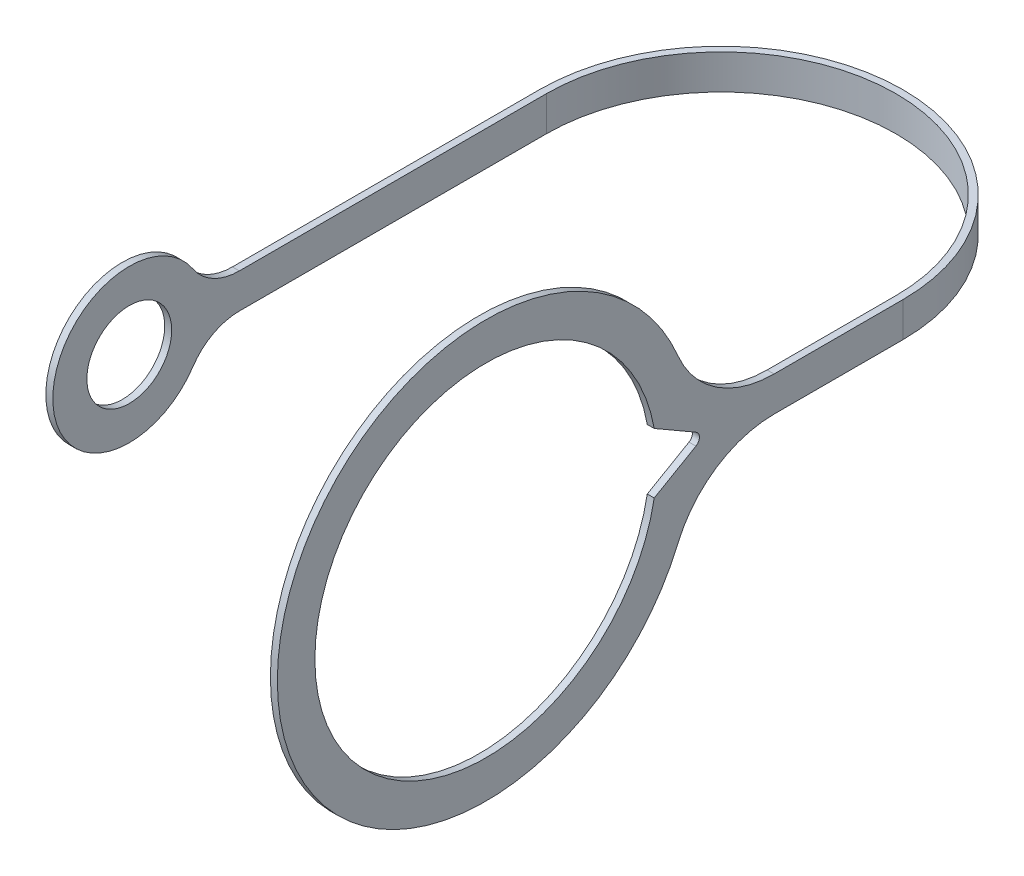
ISO-10303-21;
HEADER;
FILE_DESCRIPTION(('STEP AP214'),'2;1');
FILE_NAME('part.step','',(''),(''),'','','');
FILE_SCHEMA(('AUTOMOTIVE_DESIGN { 1 0 10303 214 1 1 1 1 }'));
ENDSEC;
DATA;
#1=APPLICATION_CONTEXT('core data for automotive mechanical design processes');
#2=APPLICATION_PROTOCOL_DEFINITION('international standard','automotive_design',2000,#1);
#3=PRODUCT_CONTEXT('',#1,'mechanical');
#4=PRODUCT('Part','Part','',(#3));
#5=PRODUCT_RELATED_PRODUCT_CATEGORY('part','',(#4));
#6=PRODUCT_DEFINITION_FORMATION('','',#4);
#7=PRODUCT_DEFINITION_CONTEXT('part definition',#1,'design');
#8=PRODUCT_DEFINITION('design','',#6,#7);
#9=PRODUCT_DEFINITION_SHAPE('','',#8);
#10=(LENGTH_UNIT() NAMED_UNIT(*) SI_UNIT(.MILLI.,.METRE.));
#11=(NAMED_UNIT(*) PLANE_ANGLE_UNIT() SI_UNIT($,.RADIAN.));
#12=(NAMED_UNIT(*) SI_UNIT($,.STERADIAN.) SOLID_ANGLE_UNIT());
#13=UNCERTAINTY_MEASURE_WITH_UNIT(LENGTH_MEASURE(1.E-05),#10,'distance_accuracy_value','');
#14=(GEOMETRIC_REPRESENTATION_CONTEXT(3) GLOBAL_UNCERTAINTY_ASSIGNED_CONTEXT((#13)) GLOBAL_UNIT_ASSIGNED_CONTEXT((#10,
#11,#12)) REPRESENTATION_CONTEXT('',''));
#15=CARTESIAN_POINT('',(0.,0.,0.));
#16=DIRECTION('',(0.,0.,1.));
#17=DIRECTION('',(1.,0.,0.));
#18=AXIS2_PLACEMENT_3D('',#15,#16,#17);
#19=CARTESIAN_POINT('',(-34.5848633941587,6.8347391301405,-7.91754381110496));
#20=DIRECTION('',(1.,0.,0.));
#21=DIRECTION('',(0.,0.,-1.));
#22=AXIS2_PLACEMENT_3D('',#19,#20,#21);
#23=CYLINDRICAL_SURFACE('',#22,4.);
#24=DIRECTION('',(1.,0.,0.));
#25=VECTOR('',#24,1.);
#26=CARTESIAN_POINT('',(-34.5848633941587,2.8347391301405,-7.91754381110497));
#27=LINE('',#26,#25);
#28=CARTESIAN_POINT('',(-34.8348633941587,2.8347391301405,-7.91754381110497));
#29=VERTEX_POINT('',#28);
#30=CARTESIAN_POINT('',(-34.3348633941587,2.8347391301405,-7.91754381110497));
#31=VERTEX_POINT('',#30);
#32=EDGE_CURVE('E131',#29,#31,#27,.T.);
#33=ORIENTED_EDGE('',*,*,#32,.F.);
#34=CARTESIAN_POINT('',(-34.8348633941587,6.8347391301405,-7.91754381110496));
#35=DIRECTION('',(1.,0.,0.));
#36=DIRECTION('',(0.,0.,-1.));
#37=AXIS2_PLACEMENT_3D('',#34,#35,#36);
#38=CIRCLE('',#37,4.);
#39=CARTESIAN_POINT('',(-34.8348633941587,4.62421281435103,-4.58384115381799));
#40=VERTEX_POINT('',#39);
#41=EDGE_CURVE('E20',#40,#29,#38,.T.);
#42=ORIENTED_EDGE('',*,*,#41,.F.);
#43=DIRECTION('',(1.,0.,0.));
#44=VECTOR('',#43,1.);
#45=CARTESIAN_POINT('',(-34.8348633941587,4.62421281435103,-4.58384115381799));
#46=LINE('',#45,#44);
#47=CARTESIAN_POINT('',(-34.3348633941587,4.62421281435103,-4.58384115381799));
#48=VERTEX_POINT('',#47);
#49=EDGE_CURVE('E129',#48,#40,#46,.F.);
#50=ORIENTED_EDGE('',*,*,#49,.F.);
#51=CARTESIAN_POINT('',(-34.3348633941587,6.8347391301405,-7.91754381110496));
#52=DIRECTION('',(1.,0.,0.));
#53=DIRECTION('',(0.,0.,-1.));
#54=AXIS2_PLACEMENT_3D('',#51,#52,#53);
#55=CIRCLE('',#54,4.);
#56=EDGE_CURVE('E154',#31,#48,#55,.F.);
#57=ORIENTED_EDGE('',*,*,#56,.F.);
#58=EDGE_LOOP('',(#33,#42,#50,#57));
#59=FACE_BOUND('',#58,.T.);
#60=ADVANCED_FACE('F17',(#59),#23,.F.);
#61=CARTESIAN_POINT('',(-34.8348633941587,1.5847391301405,-4.840794E-11));
#62=DIRECTION('',(1.,0.,0.));
#63=DIRECTION('',(0.,0.,-1.));
#64=AXIS2_PLACEMENT_3D('',#61,#62,#63);
#65=CYLINDRICAL_SURFACE('',#64,5.5);
#66=CARTESIAN_POINT('',(-34.3348633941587,1.5847391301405,-4.840794E-11));
#67=DIRECTION('',(1.,0.,0.));
#68=DIRECTION('',(0.,0.,-1.));
#69=AXIS2_PLACEMENT_3D('',#66,#67,#68);
#70=CIRCLE('',#69,5.5);
#71=CARTESIAN_POINT('',(-34.3348633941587,-1.45473455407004,-4.58384115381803));
#72=VERTEX_POINT('',#71);
#73=EDGE_CURVE('E144',#48,#72,#70,.T.);
#74=ORIENTED_EDGE('',*,*,#73,.F.);
#75=ORIENTED_EDGE('',*,*,#49,.T.);
#76=CARTESIAN_POINT('',(-34.8348633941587,1.5847391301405,-4.840794E-11));
#77=DIRECTION('',(1.,0.,0.));
#78=DIRECTION('',(0.,0.,-1.));
#79=AXIS2_PLACEMENT_3D('',#76,#77,#78);
#80=CIRCLE('',#79,5.5);
#81=CARTESIAN_POINT('',(-34.8348633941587,-1.45473455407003,-4.58384115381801));
#82=VERTEX_POINT('',#81);
#83=EDGE_CURVE('E141',#82,#40,#80,.F.);
#84=ORIENTED_EDGE('',*,*,#83,.F.);
#85=DIRECTION('',(1.,0.,0.));
#86=VECTOR('',#85,1.);
#87=CARTESIAN_POINT('',(-34.5848633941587,-1.45473455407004,-4.58384115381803));
#88=LINE('',#87,#86);
#89=EDGE_CURVE('E137',#82,#72,#88,.T.);
#90=ORIENTED_EDGE('',*,*,#89,.T.);
#91=EDGE_LOOP('',(#74,#75,#84,#90));
#92=FACE_BOUND('',#91,.T.);
#93=ADVANCED_FACE('F140',(#92),#65,.T.);
#94=CARTESIAN_POINT('',(-34.5848633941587,-3.66526086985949,-7.91754381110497));
#95=DIRECTION('',(1.,0.,0.));
#96=DIRECTION('',(0.,0.,-1.));
#97=AXIS2_PLACEMENT_3D('',#94,#95,#96);
#98=CYLINDRICAL_SURFACE('',#97,3.99999999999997);
#99=ORIENTED_EDGE('',*,*,#89,.F.);
#100=CARTESIAN_POINT('',(-34.8348633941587,-3.66526086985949,-7.91754381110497));
#101=DIRECTION('',(1.,0.,0.));
#102=DIRECTION('',(0.,0.,-1.));
#103=AXIS2_PLACEMENT_3D('',#100,#101,#102);
#104=CIRCLE('',#103,3.99999999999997);
#105=CARTESIAN_POINT('',(-34.8348633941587,0.334739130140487,-7.91754381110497));
#106=VERTEX_POINT('',#105);
#107=EDGE_CURVE('E136',#106,#82,#104,.T.);
#108=ORIENTED_EDGE('',*,*,#107,.F.);
#109=DIRECTION('',(1.,0.,0.));
#110=VECTOR('',#109,1.);
#111=CARTESIAN_POINT('',(-34.5848633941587,0.334739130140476,-7.91754381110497));
#112=LINE('',#111,#110);
#113=CARTESIAN_POINT('',(-34.3348633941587,0.334739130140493,-7.91754381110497));
#114=VERTEX_POINT('',#113);
#115=EDGE_CURVE('E146',#114,#106,#112,.F.);
#116=ORIENTED_EDGE('',*,*,#115,.F.);
#117=CARTESIAN_POINT('',(-34.3348633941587,-3.66526086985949,-7.91754381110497));
#118=DIRECTION('',(1.,0.,0.));
#119=DIRECTION('',(0.,0.,-1.));
#120=AXIS2_PLACEMENT_3D('',#117,#118,#119);
#121=CIRCLE('',#120,3.99999999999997);
#122=EDGE_CURVE('E159',#72,#114,#121,.F.);
#123=ORIENTED_EDGE('',*,*,#122,.F.);
#124=EDGE_LOOP('',(#99,#108,#116,#123));
#125=FACE_BOUND('',#124,.T.);
#126=ADVANCED_FACE('F424',(#125),#98,.F.);
#127=CARTESIAN_POINT('',(-34.5848633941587,1.5847391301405,-4.840794E-11));
#128=DIRECTION('',(1.,0.,0.));
#129=DIRECTION('',(0.,0.,-1.));
#130=AXIS2_PLACEMENT_3D('',#127,#128,#129);
#131=CYLINDRICAL_SURFACE('',#130,3.05);
#132=CARTESIAN_POINT('',(-34.3348633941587,1.5847391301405,-4.840794E-11));
#133=DIRECTION('',(1.,0.,0.));
#134=DIRECTION('',(0.,0.,-1.));
#135=AXIS2_PLACEMENT_3D('',#132,#133,#134);
#136=CIRCLE('',#135,3.05);
#137=CARTESIAN_POINT('',(-34.3348633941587,1.5847391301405,-3.05000000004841));
#138=VERTEX_POINT('',#137);
#139=EDGE_CURVE('E162',#138,#138,#136,.F.);
#140=ORIENTED_EDGE('',*,*,#139,.F.);
#141=EDGE_LOOP('',(#140));
#142=FACE_BOUND('',#141,.T.);
#143=CARTESIAN_POINT('',(-34.8348633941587,1.5847391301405,-4.840794E-11));
#144=DIRECTION('',(1.,0.,0.));
#145=DIRECTION('',(0.,0.,-1.));
#146=AXIS2_PLACEMENT_3D('',#143,#144,#145);
#147=CIRCLE('',#146,3.05);
#148=CARTESIAN_POINT('',(-34.8348633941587,1.5847391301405,-3.05000000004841));
#149=VERTEX_POINT('',#148);
#150=EDGE_CURVE('E151',#149,#149,#147,.T.);
#151=ORIENTED_EDGE('',*,*,#150,.F.);
#152=EDGE_LOOP('',(#151));
#153=FACE_BOUND('',#152,.T.);
#154=ADVANCED_FACE('F415',(#142,#153),#131,.F.);
#155=CARTESIAN_POINT('',(-34.8348633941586,1.58473913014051,-30.0000000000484));
#156=DIRECTION('',(-1.,0.,0.));
#157=DIRECTION('',(0.,0.,1.));
#158=AXIS2_PLACEMENT_3D('',#155,#156,#157);
#159=PLANE('',#158);
#160=ORIENTED_EDGE('',*,*,#150,.T.);
#161=EDGE_LOOP('',(#160));
#162=FACE_BOUND('',#161,.T.);
#163=ORIENTED_EDGE('',*,*,#107,.T.);
#164=ORIENTED_EDGE('',*,*,#83,.T.);
#165=ORIENTED_EDGE('',*,*,#41,.T.);
#166=DIRECTION('',(0.,0.,1.));
#167=VECTOR('',#166,1.);
#168=CARTESIAN_POINT('',(-34.8348633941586,2.8347391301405,-23.8655654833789));
#169=LINE('',#168,#167);
#170=CARTESIAN_POINT('',(-34.8348633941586,2.83473913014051,-30.0000000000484));
#171=VERTEX_POINT('',#170);
#172=EDGE_CURVE('E183',#171,#29,#169,.T.);
#173=ORIENTED_EDGE('',*,*,#172,.F.);
#174=DIRECTION('',(0.,-1.,0.));
#175=VECTOR('',#174,1.);
#176=CARTESIAN_POINT('',(-34.8348633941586,1.5847391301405,-30.0000000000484));
#177=LINE('',#176,#175);
#178=CARTESIAN_POINT('',(-34.8348633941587,0.334739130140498,-30.0000000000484));
#179=VERTEX_POINT('',#178);
#180=EDGE_CURVE('E178',#179,#171,#177,.F.);
#181=ORIENTED_EDGE('',*,*,#180,.F.);
#182=DIRECTION('',(0.,0.,-1.));
#183=VECTOR('',#182,1.);
#184=CARTESIAN_POINT('',(-34.8348633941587,0.334739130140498,-23.8655654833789));
#185=LINE('',#184,#183);
#186=EDGE_CURVE('E179',#106,#179,#185,.T.);
#187=ORIENTED_EDGE('',*,*,#186,.F.);
#188=EDGE_LOOP('',(#163,#164,#165,#173,#181,#187));
#189=FACE_BOUND('',#188,.T.);
#190=ADVANCED_FACE('F148',(#162,#189),#159,.T.);
#191=CARTESIAN_POINT('',(-34.3348633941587,1.5847391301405,-4.840794E-11));
#192=DIRECTION('',(1.,0.,0.));
#193=DIRECTION('',(0.,0.,-1.));
#194=AXIS2_PLACEMENT_3D('',#191,#192,#193);
#195=PLANE('',#194);
#196=ORIENTED_EDGE('',*,*,#139,.T.);
#197=EDGE_LOOP('',(#196));
#198=FACE_BOUND('',#197,.T.);
#199=ORIENTED_EDGE('',*,*,#73,.T.);
#200=ORIENTED_EDGE('',*,*,#122,.T.);
#201=DIRECTION('',(0.,0.,-1.));
#202=VECTOR('',#201,1.);
#203=CARTESIAN_POINT('',(-34.3348633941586,0.334739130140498,-23.8655654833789));
#204=LINE('',#203,#202);
#205=CARTESIAN_POINT('',(-34.3348633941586,0.334739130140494,-30.0000000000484));
#206=VERTEX_POINT('',#205);
#207=EDGE_CURVE('E173',#206,#114,#204,.F.);
#208=ORIENTED_EDGE('',*,*,#207,.F.);
#209=DIRECTION('',(0.,-1.,0.));
#210=VECTOR('',#209,1.);
#211=CARTESIAN_POINT('',(-34.3348633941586,1.5847391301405,-30.0000000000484));
#212=LINE('',#211,#210);
#213=CARTESIAN_POINT('',(-34.3348633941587,2.83473913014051,-30.0000000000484));
#214=VERTEX_POINT('',#213);
#215=EDGE_CURVE('E165',#206,#214,#212,.F.);
#216=ORIENTED_EDGE('',*,*,#215,.T.);
#217=DIRECTION('',(0.,0.,1.));
#218=VECTOR('',#217,1.);
#219=CARTESIAN_POINT('',(-34.3348633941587,2.8347391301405,-23.8655654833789));
#220=LINE('',#219,#218);
#221=EDGE_CURVE('E188',#31,#214,#220,.F.);
#222=ORIENTED_EDGE('',*,*,#221,.F.);
#223=ORIENTED_EDGE('',*,*,#56,.T.);
#224=EDGE_LOOP('',(#199,#200,#208,#216,#222,#223));
#225=FACE_BOUND('',#224,.T.);
#226=ADVANCED_FACE('F398',(#198,#225),#195,.T.);
#227=CARTESIAN_POINT('',(-21.7598633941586,1.5847391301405,-30.0000000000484));
#228=DIRECTION('',(0.,-1.,0.));
#229=DIRECTION('',(0.,0.,-1.));
#230=AXIS2_PLACEMENT_3D('',#227,#228,#229);
#231=CYLINDRICAL_SURFACE('',#230,12.575);
#232=DIRECTION('',(0.,1.,0.));
#233=VECTOR('',#232,1.);
#234=CARTESIAN_POINT('',(-9.18486339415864,1.58473913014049,-30.0000000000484));
#235=LINE('',#234,#233);
#236=CARTESIAN_POINT('',(-9.18486339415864,2.83473913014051,-30.0000000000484));
#237=VERTEX_POINT('',#236);
#238=CARTESIAN_POINT('',(-9.18486229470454,0.33473913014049,-30.0000000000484));
#239=VERTEX_POINT('',#238);
#240=EDGE_CURVE('E169',#237,#239,#235,.F.);
#241=ORIENTED_EDGE('',*,*,#240,.F.);
#242=CARTESIAN_POINT('',(-21.7598633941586,2.83473913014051,-30.0000000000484));
#243=DIRECTION('',(0.,-1.,0.));
#244=DIRECTION('',(0.,0.,-1.));
#245=AXIS2_PLACEMENT_3D('',#242,#243,#244);
#246=CIRCLE('',#245,12.575);
#247=EDGE_CURVE('E184',#214,#237,#246,.T.);
#248=ORIENTED_EDGE('',*,*,#247,.F.);
#249=ORIENTED_EDGE('',*,*,#215,.F.);
#250=CARTESIAN_POINT('',(-21.7598633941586,0.33473913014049,-30.0000000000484));
#251=DIRECTION('',(0.,-1.,0.));
#252=DIRECTION('',(0.,0.,-1.));
#253=AXIS2_PLACEMENT_3D('',#250,#251,#252);
#254=CIRCLE('',#253,12.575);
#255=EDGE_CURVE('E170',#239,#206,#254,.F.);
#256=ORIENTED_EDGE('',*,*,#255,.F.);
#257=EDGE_LOOP('',(#241,#248,#249,#256));
#258=FACE_BOUND('',#257,.T.);
#259=ADVANCED_FACE('F390',(#258),#231,.F.);
#260=CARTESIAN_POINT('',(-9.18486339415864,1.58473913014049,-30.0000000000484));
#261=DIRECTION('',(-1.,0.,0.));
#262=DIRECTION('',(0.,0.,1.));
#263=AXIS2_PLACEMENT_3D('',#260,#261,#262);
#264=PLANE('',#263);
#265=DIRECTION('',(0.,-0.500000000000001,0.866025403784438));
#266=VECTOR('',#265,1.);
#267=CARTESIAN_POINT('',(-9.18486229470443,-0.58032437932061,-12.1079519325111));
#268=LINE('',#267,#266);
#269=CARTESIAN_POINT('',(-9.18486284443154,1.15172642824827,-15.1079519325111));
#270=VERTEX_POINT('',#269);
#271=CARTESIAN_POINT('',(-9.18486284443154,-0.580324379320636,-12.107951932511));
#272=VERTEX_POINT('',#271);
#273=EDGE_CURVE('E201',#270,#272,#268,.T.);
#274=ORIENTED_EDGE('',*,*,#273,.F.);
#275=CARTESIAN_POINT('',(-9.18486339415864,1.58473913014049,-14.8579519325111));
#276=DIRECTION('',(-1.,0.,0.));
#277=DIRECTION('',(0.,0.,1.));
#278=AXIS2_PLACEMENT_3D('',#275,#276,#277);
#279=CIRCLE('',#278,0.500000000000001);
#280=CARTESIAN_POINT('',(-9.18486284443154,2.01775183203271,-15.1079519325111));
#281=VERTEX_POINT('',#280);
#282=EDGE_CURVE('E198',#270,#281,#279,.F.);
#283=ORIENTED_EDGE('',*,*,#282,.T.);
#284=DIRECTION('',(0.,-0.5,-0.866025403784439));
#285=VECTOR('',#284,1.);
#286=CARTESIAN_POINT('',(-9.18486229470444,2.01775183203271,-15.1079519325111));
#287=LINE('',#286,#285);
#288=CARTESIAN_POINT('',(-9.18486284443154,3.74980263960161,-12.107951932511));
#289=VERTEX_POINT('',#288);
#290=EDGE_CURVE('E230',#289,#281,#287,.T.);
#291=ORIENTED_EDGE('',*,*,#290,.F.);
#292=CARTESIAN_POINT('',(-9.18486339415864,1.58473913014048,0.));
#293=DIRECTION('',(-1.,0.,0.));
#294=DIRECTION('',(0.,0.,1.));
#295=AXIS2_PLACEMENT_3D('',#292,#293,#294);
#296=CIRCLE('',#295,12.3);
#297=EDGE_CURVE('E203',#289,#272,#296,.F.);
#298=ORIENTED_EDGE('',*,*,#297,.T.);
#299=EDGE_LOOP('',(#274,#283,#291,#298));
#300=FACE_BOUND('',#299,.T.);
#301=CARTESIAN_POINT('',(-9.18486339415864,1.58473913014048,0.));
#302=DIRECTION('',(-1.,0.,0.));
#303=DIRECTION('',(0.,0.,1.));
#304=AXIS2_PLACEMENT_3D('',#301,#302,#303);
#305=CIRCLE('',#304,15.);
#306=CARTESIAN_POINT('',(-9.18486339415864,7.41807246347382,-13.8192699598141));
#307=VERTEX_POINT('',#306);
#308=CARTESIAN_POINT('',(-9.18486339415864,-4.24859420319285,-13.8192699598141));
#309=VERTEX_POINT('',#308);
#310=EDGE_CURVE('E194',#307,#309,#305,.F.);
#311=ORIENTED_EDGE('',*,*,#310,.F.);
#312=CARTESIAN_POINT('',(-9.18486339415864,10.3347391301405,-20.7289049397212));
#313=DIRECTION('',(-1.,0.,0.));
#314=DIRECTION('',(0.,0.,1.));
#315=AXIS2_PLACEMENT_3D('',#312,#313,#314);
#316=CIRCLE('',#315,7.50000000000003);
#317=CARTESIAN_POINT('',(-9.18486339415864,2.83473913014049,-20.7289049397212));
#318=VERTEX_POINT('',#317);
#319=EDGE_CURVE('E189',#307,#318,#316,.F.);
#320=ORIENTED_EDGE('',*,*,#319,.T.);
#321=DIRECTION('',(0.,0.,1.));
#322=VECTOR('',#321,1.);
#323=CARTESIAN_POINT('',(-9.18486339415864,2.8347391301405,-23.8655654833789));
#324=LINE('',#323,#322);
#325=EDGE_CURVE('E187',#237,#318,#324,.T.);
#326=ORIENTED_EDGE('',*,*,#325,.F.);
#327=ORIENTED_EDGE('',*,*,#240,.T.);
#328=DIRECTION('',(0.,0.,-1.));
#329=VECTOR('',#328,1.);
#330=CARTESIAN_POINT('',(-9.18486119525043,0.334739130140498,-23.8655654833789));
#331=LINE('',#330,#329);
#332=CARTESIAN_POINT('',(-9.18486229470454,0.334739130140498,-20.7289049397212));
#333=VERTEX_POINT('',#332);
#334=EDGE_CURVE('E174',#333,#239,#331,.T.);
#335=ORIENTED_EDGE('',*,*,#334,.F.);
#336=CARTESIAN_POINT('',(-9.18486339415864,-7.16526086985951,-20.7289049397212));
#337=DIRECTION('',(-1.,0.,0.));
#338=DIRECTION('',(0.,0.,1.));
#339=AXIS2_PLACEMENT_3D('',#336,#337,#338);
#340=CIRCLE('',#339,7.49999999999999);
#341=EDGE_CURVE('E166',#333,#309,#340,.F.);
#342=ORIENTED_EDGE('',*,*,#341,.T.);
#343=EDGE_LOOP('',(#311,#320,#326,#327,#335,#342));
#344=FACE_BOUND('',#343,.T.);
#345=ADVANCED_FACE('F274',(#300,#344),#264,.T.);
#346=CARTESIAN_POINT('',(-8.93486119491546,-7.16526086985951,-20.7289049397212));
#347=DIRECTION('',(-1.,0.,0.));
#348=DIRECTION('',(0.,0.,1.));
#349=AXIS2_PLACEMENT_3D('',#346,#347,#348);
#350=CYLINDRICAL_SURFACE('',#349,7.49999999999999);
#351=DIRECTION('',(1.,0.,0.));
#352=VECTOR('',#351,1.);
#353=CARTESIAN_POINT('',(-21.7598629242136,0.334739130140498,-20.7289049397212));
#354=LINE('',#353,#352);
#355=CARTESIAN_POINT('',(-8.68486119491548,0.334739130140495,-20.7289049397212));
#356=VERTEX_POINT('',#355);
#357=EDGE_CURVE('E168',#356,#333,#354,.F.);
#358=ORIENTED_EDGE('',*,*,#357,.F.);
#359=CARTESIAN_POINT('',(-8.68486119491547,-7.16526086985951,-20.7289049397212));
#360=DIRECTION('',(-1.,0.,0.));
#361=DIRECTION('',(0.,0.,1.));
#362=AXIS2_PLACEMENT_3D('',#359,#360,#361);
#363=CIRCLE('',#362,7.49999999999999);
#364=CARTESIAN_POINT('',(-8.68486119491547,-4.24859420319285,-13.8192699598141));
#365=VERTEX_POINT('',#364);
#366=EDGE_CURVE('E206',#365,#356,#363,.T.);
#367=ORIENTED_EDGE('',*,*,#366,.F.);
#368=DIRECTION('',(-1.,0.,0.));
#369=VECTOR('',#368,1.);
#370=CARTESIAN_POINT('',(-8.68486119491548,-4.24859420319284,-13.8192699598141));
#371=LINE('',#370,#369);
#372=EDGE_CURVE('E197',#309,#365,#371,.F.);
#373=ORIENTED_EDGE('',*,*,#372,.F.);
#374=ORIENTED_EDGE('',*,*,#341,.F.);
#375=EDGE_LOOP('',(#358,#367,#373,#374));
#376=FACE_BOUND('',#375,.T.);
#377=ADVANCED_FACE('F373',(#376),#350,.F.);
#378=CARTESIAN_POINT('',(-21.7598629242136,0.334739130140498,-23.8655654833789));
#379=DIRECTION('',(0.,-1.,0.));
#380=DIRECTION('',(0.,0.,-1.));
#381=AXIS2_PLACEMENT_3D('',#378,#379,#380);
#382=PLANE('',#381);
#383=CARTESIAN_POINT('',(-21.7598633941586,0.334739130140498,-30.0000000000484));
#384=DIRECTION('',(0.,-1.,0.));
#385=DIRECTION('',(0.,0.,-1.));
#386=AXIS2_PLACEMENT_3D('',#383,#384,#385);
#387=CIRCLE('',#386,13.075);
#388=CARTESIAN_POINT('',(-8.68486229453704,0.334739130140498,-30.0000000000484));
#389=VERTEX_POINT('',#388);
#390=EDGE_CURVE('E175',#389,#179,#387,.F.);
#391=ORIENTED_EDGE('',*,*,#390,.F.);
#392=DIRECTION('',(0.,0.,-1.));
#393=VECTOR('',#392,1.);
#394=CARTESIAN_POINT('',(-8.68486119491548,0.334739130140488,-4.837908E-11));
#395=LINE('',#394,#393);
#396=EDGE_CURVE('E210',#356,#389,#395,.T.);
#397=ORIENTED_EDGE('',*,*,#396,.F.);
#398=ORIENTED_EDGE('',*,*,#357,.T.);
#399=ORIENTED_EDGE('',*,*,#334,.T.);
#400=ORIENTED_EDGE('',*,*,#255,.T.);
#401=ORIENTED_EDGE('',*,*,#207,.T.);
#402=ORIENTED_EDGE('',*,*,#115,.T.);
#403=ORIENTED_EDGE('',*,*,#186,.T.);
#404=EDGE_LOOP('',(#391,#397,#398,#399,#400,#401,#402,#403));
#405=FACE_BOUND('',#404,.T.);
#406=ADVANCED_FACE('F364',(#405),#382,.T.);
#407=CARTESIAN_POINT('',(-21.7598633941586,1.5847391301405,-30.0000000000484));
#408=DIRECTION('',(0.,-1.,0.));
#409=DIRECTION('',(0.,0.,-1.));
#410=AXIS2_PLACEMENT_3D('',#407,#408,#409);
#411=CYLINDRICAL_SURFACE('',#410,13.075);
#412=CARTESIAN_POINT('',(-21.7598633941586,2.83473913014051,-30.0000000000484));
#413=DIRECTION('',(0.,-1.,0.));
#414=DIRECTION('',(0.,0.,-1.));
#415=AXIS2_PLACEMENT_3D('',#412,#413,#414);
#416=CIRCLE('',#415,13.075);
#417=CARTESIAN_POINT('',(-8.68486229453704,2.83473913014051,-30.0000000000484));
#418=VERTEX_POINT('',#417);
#419=EDGE_CURVE('E180',#418,#171,#416,.F.);
#420=ORIENTED_EDGE('',*,*,#419,.F.);
#421=DIRECTION('',(0.,1.,0.));
#422=VECTOR('',#421,1.);
#423=CARTESIAN_POINT('',(-8.68486119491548,1.58473913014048,-30.0000000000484));
#424=LINE('',#423,#422);
#425=EDGE_CURVE('E239',#389,#418,#424,.T.);
#426=ORIENTED_EDGE('',*,*,#425,.F.);
#427=ORIENTED_EDGE('',*,*,#390,.T.);
#428=ORIENTED_EDGE('',*,*,#180,.T.);
#429=EDGE_LOOP('',(#420,#426,#427,#428));
#430=FACE_BOUND('',#429,.T.);
#431=ADVANCED_FACE('F355',(#430),#411,.T.);
#432=CARTESIAN_POINT('',(-21.7598629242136,2.8347391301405,-23.8655654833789));
#433=DIRECTION('',(0.,1.,0.));
#434=DIRECTION('',(0.,0.,1.));
#435=AXIS2_PLACEMENT_3D('',#432,#433,#434);
#436=PLANE('',#435);
#437=ORIENTED_EDGE('',*,*,#247,.T.);
#438=ORIENTED_EDGE('',*,*,#325,.T.);
#439=DIRECTION('',(-1.,0.,0.));
#440=VECTOR('',#439,1.);
#441=CARTESIAN_POINT('',(-8.93486119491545,2.83473913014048,-20.7289049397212));
#442=LINE('',#441,#440);
#443=CARTESIAN_POINT('',(-8.68486119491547,2.83473913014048,-20.7289049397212));
#444=VERTEX_POINT('',#443);
#445=EDGE_CURVE('E193',#318,#444,#442,.F.);
#446=ORIENTED_EDGE('',*,*,#445,.T.);
#447=DIRECTION('',(0.,0.,-1.));
#448=VECTOR('',#447,1.);
#449=CARTESIAN_POINT('',(-8.68486119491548,2.8347391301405,-4.837908E-11));
#450=LINE('',#449,#448);
#451=EDGE_CURVE('E215',#418,#444,#450,.F.);
#452=ORIENTED_EDGE('',*,*,#451,.F.);
#453=ORIENTED_EDGE('',*,*,#419,.T.);
#454=ORIENTED_EDGE('',*,*,#172,.T.);
#455=ORIENTED_EDGE('',*,*,#32,.T.);
#456=ORIENTED_EDGE('',*,*,#221,.T.);
#457=EDGE_LOOP('',(#437,#438,#446,#452,#453,#454,#455,#456));
#458=FACE_BOUND('',#457,.T.);
#459=ADVANCED_FACE('F346',(#458),#436,.T.);
#460=CARTESIAN_POINT('',(-8.93486119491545,10.3347391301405,-20.7289049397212));
#461=DIRECTION('',(-1.,0.,0.));
#462=DIRECTION('',(0.,0.,1.));
#463=AXIS2_PLACEMENT_3D('',#460,#461,#462);
#464=CYLINDRICAL_SURFACE('',#463,7.50000000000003);
#465=DIRECTION('',(-1.,0.,0.));
#466=VECTOR('',#465,1.);
#467=CARTESIAN_POINT('',(-8.68486119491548,7.41807246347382,-13.8192699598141));
#468=LINE('',#467,#466);
#469=CARTESIAN_POINT('',(-8.68486119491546,7.41807246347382,-13.8192699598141));
#470=VERTEX_POINT('',#469);
#471=EDGE_CURVE('E192',#470,#307,#468,.T.);
#472=ORIENTED_EDGE('',*,*,#471,.F.);
#473=CARTESIAN_POINT('',(-8.68486119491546,10.3347391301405,-20.7289049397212));
#474=DIRECTION('',(-1.,0.,0.));
#475=DIRECTION('',(0.,0.,1.));
#476=AXIS2_PLACEMENT_3D('',#473,#474,#475);
#477=CIRCLE('',#476,7.50000000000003);
#478=EDGE_CURVE('E211',#444,#470,#477,.T.);
#479=ORIENTED_EDGE('',*,*,#478,.F.);
#480=ORIENTED_EDGE('',*,*,#445,.F.);
#481=ORIENTED_EDGE('',*,*,#319,.F.);
#482=EDGE_LOOP('',(#472,#479,#480,#481));
#483=FACE_BOUND('',#482,.T.);
#484=ADVANCED_FACE('F291',(#483),#464,.F.);
#485=CARTESIAN_POINT('',(-8.68486119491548,1.58473913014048,0.));
#486=DIRECTION('',(-1.,0.,0.));
#487=DIRECTION('',(0.,0.,1.));
#488=AXIS2_PLACEMENT_3D('',#485,#486,#487);
#489=CYLINDRICAL_SURFACE('',#488,15.);
#490=ORIENTED_EDGE('',*,*,#310,.T.);
#491=ORIENTED_EDGE('',*,*,#372,.T.);
#492=CARTESIAN_POINT('',(-8.68486119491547,1.58473913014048,0.));
#493=DIRECTION('',(-1.,0.,0.));
#494=DIRECTION('',(0.,0.,1.));
#495=AXIS2_PLACEMENT_3D('',#492,#493,#494);
#496=CIRCLE('',#495,15.);
#497=EDGE_CURVE('E214',#470,#365,#496,.F.);
#498=ORIENTED_EDGE('',*,*,#497,.F.);
#499=ORIENTED_EDGE('',*,*,#471,.T.);
#500=EDGE_LOOP('',(#490,#491,#498,#499));
#501=FACE_BOUND('',#500,.T.);
#502=ADVANCED_FACE('F283',(#501),#489,.T.);
#503=CARTESIAN_POINT('',(-8.68486119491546,2.01775183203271,-15.1079519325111));
#504=DIRECTION('',(0.,-0.866025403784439,0.5));
#505=DIRECTION('',(0.,-0.5,-0.866025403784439));
#506=AXIS2_PLACEMENT_3D('',#503,#504,#505);
#507=PLANE('',#506);
#508=DIRECTION('',(0.,-0.500000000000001,-0.866025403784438));
#509=VECTOR('',#508,1.);
#510=CARTESIAN_POINT('',(-8.68486119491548,3.74980263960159,-12.1079519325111));
#511=LINE('',#510,#509);
#512=CARTESIAN_POINT('',(-8.68486119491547,3.74980263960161,-12.107951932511));
#513=VERTEX_POINT('',#512);
#514=CARTESIAN_POINT('',(-8.68486119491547,2.01775183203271,-15.1079519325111));
#515=VERTEX_POINT('',#514);
#516=EDGE_CURVE('E218',#513,#515,#511,.T.);
#517=ORIENTED_EDGE('',*,*,#516,.F.);
#518=DIRECTION('',(-1.,0.,0.));
#519=VECTOR('',#518,1.);
#520=CARTESIAN_POINT('',(-8.93486229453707,3.74980263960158,-12.107951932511));
#521=LINE('',#520,#519);
#522=EDGE_CURVE('E207',#513,#289,#521,.T.);
#523=ORIENTED_EDGE('',*,*,#522,.T.);
#524=ORIENTED_EDGE('',*,*,#290,.T.);
#525=DIRECTION('',(-1.,0.,0.));
#526=VECTOR('',#525,1.);
#527=CARTESIAN_POINT('',(-8.93486229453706,2.01775183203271,-15.1079519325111));
#528=LINE('',#527,#526);
#529=EDGE_CURVE('E202',#281,#515,#528,.F.);
#530=ORIENTED_EDGE('',*,*,#529,.T.);
#531=EDGE_LOOP('',(#517,#523,#524,#530));
#532=FACE_BOUND('',#531,.T.);
#533=ADVANCED_FACE('F281',(#532),#507,.T.);
#534=CARTESIAN_POINT('',(-8.93486229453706,1.58473913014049,-14.8579519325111));
#535=DIRECTION('',(-1.,0.,0.));
#536=DIRECTION('',(0.,0.,1.));
#537=AXIS2_PLACEMENT_3D('',#534,#535,#536);
#538=CYLINDRICAL_SURFACE('',#537,0.500000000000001);
#539=DIRECTION('',(1.,0.,0.));
#540=VECTOR('',#539,1.);
#541=CARTESIAN_POINT('',(-8.68486119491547,1.15172642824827,-15.1079519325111));
#542=LINE('',#541,#540);
#543=CARTESIAN_POINT('',(-8.68486119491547,1.15172642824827,-15.1079519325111));
#544=VERTEX_POINT('',#543);
#545=EDGE_CURVE('E229',#544,#270,#542,.F.);
#546=ORIENTED_EDGE('',*,*,#545,.F.);
#547=CARTESIAN_POINT('',(-8.68486119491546,1.58473913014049,-14.8579519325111));
#548=DIRECTION('',(-1.,0.,0.));
#549=DIRECTION('',(0.,0.,1.));
#550=AXIS2_PLACEMENT_3D('',#547,#548,#549);
#551=CIRCLE('',#550,0.500000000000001);
#552=EDGE_CURVE('E219',#515,#544,#551,.T.);
#553=ORIENTED_EDGE('',*,*,#552,.F.);
#554=ORIENTED_EDGE('',*,*,#529,.F.);
#555=ORIENTED_EDGE('',*,*,#282,.F.);
#556=EDGE_LOOP('',(#546,#553,#554,#555));
#557=FACE_BOUND('',#556,.T.);
#558=ADVANCED_FACE('F271',(#557),#538,.F.);
#559=CARTESIAN_POINT('',(-8.68486119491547,-0.58032437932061,-12.1079519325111));
#560=DIRECTION('',(0.,0.866025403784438,0.500000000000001));
#561=DIRECTION('',(0.,-0.500000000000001,0.866025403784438));
#562=AXIS2_PLACEMENT_3D('',#559,#560,#561);
#563=PLANE('',#562);
#564=DIRECTION('',(0.,-0.500000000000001,0.866025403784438));
#565=VECTOR('',#564,1.);
#566=CARTESIAN_POINT('',(-8.68486119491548,1.15172642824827,-15.1079519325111));
#567=LINE('',#566,#565);
#568=CARTESIAN_POINT('',(-8.68486119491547,-0.580324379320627,-12.107951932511));
#569=VERTEX_POINT('',#568);
#570=EDGE_CURVE('E26',#544,#569,#567,.T.);
#571=ORIENTED_EDGE('',*,*,#570,.F.);
#572=ORIENTED_EDGE('',*,*,#545,.T.);
#573=ORIENTED_EDGE('',*,*,#273,.T.);
#574=DIRECTION('',(-1.,0.,0.));
#575=VECTOR('',#574,1.);
#576=CARTESIAN_POINT('',(-8.93486229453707,-0.5803243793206,-12.107951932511));
#577=LINE('',#576,#575);
#578=EDGE_CURVE('E35',#272,#569,#577,.F.);
#579=ORIENTED_EDGE('',*,*,#578,.T.);
#580=EDGE_LOOP('',(#571,#572,#573,#579));
#581=FACE_BOUND('',#580,.T.);
#582=ADVANCED_FACE('F268',(#581),#563,.T.);
#583=CARTESIAN_POINT('',(-8.93486229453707,1.58473913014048,0.));
#584=DIRECTION('',(-1.,0.,0.));
#585=DIRECTION('',(0.,-1.,0.));
#586=AXIS2_PLACEMENT_3D('',#583,#584,#585);
#587=CYLINDRICAL_SURFACE('',#586,12.3);
#588=ORIENTED_EDGE('',*,*,#522,.F.);
#589=CARTESIAN_POINT('',(-8.68486119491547,1.58473913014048,0.));
#590=DIRECTION('',(-1.,0.,0.));
#591=DIRECTION('',(0.,-1.,0.));
#592=AXIS2_PLACEMENT_3D('',#589,#590,#591);
#593=CIRCLE('',#592,12.3);
#594=EDGE_CURVE('E11',#569,#513,#593,.T.);
#595=ORIENTED_EDGE('',*,*,#594,.F.);
#596=ORIENTED_EDGE('',*,*,#578,.F.);
#597=ORIENTED_EDGE('',*,*,#297,.F.);
#598=EDGE_LOOP('',(#588,#595,#596,#597));
#599=FACE_BOUND('',#598,.T.);
#600=ADVANCED_FACE('F279',(#599),#587,.F.);
#601=CARTESIAN_POINT('',(-8.68486119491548,1.58473913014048,-4.837908E-11));
#602=DIRECTION('',(1.,0.,0.));
#603=DIRECTION('',(0.,0.,-1.));
#604=AXIS2_PLACEMENT_3D('',#601,#602,#603);
#605=PLANE('',#604);
#606=ORIENTED_EDGE('',*,*,#570,.T.);
#607=ORIENTED_EDGE('',*,*,#594,.T.);
#608=ORIENTED_EDGE('',*,*,#516,.T.);
#609=ORIENTED_EDGE('',*,*,#552,.T.);
#610=EDGE_LOOP('',(#606,#607,#608,#609));
#611=FACE_BOUND('',#610,.T.);
#612=ORIENTED_EDGE('',*,*,#478,.T.);
#613=ORIENTED_EDGE('',*,*,#497,.T.);
#614=ORIENTED_EDGE('',*,*,#366,.T.);
#615=ORIENTED_EDGE('',*,*,#396,.T.);
#616=ORIENTED_EDGE('',*,*,#425,.T.);
#617=ORIENTED_EDGE('',*,*,#451,.T.);
#618=EDGE_LOOP('',(#612,#613,#614,#615,#616,#617));
#619=FACE_BOUND('',#618,.T.);
#620=ADVANCED_FACE('F265',(#611,#619),#605,.T.);
#621=CLOSED_SHELL('',(#60,#93,#126,#154,#190,#226,#259,#345,#377,#406,#431,#459,#484,#502,#533,
#558,#582,#600,#620));
#622=MANIFOLD_SOLID_BREP('B1',#621);
#623=ADVANCED_BREP_SHAPE_REPRESENTATION('',(#18,#622),#14);
#624=SHAPE_DEFINITION_REPRESENTATION(#9,#623);
ENDSEC;
END-ISO-10303-21;
